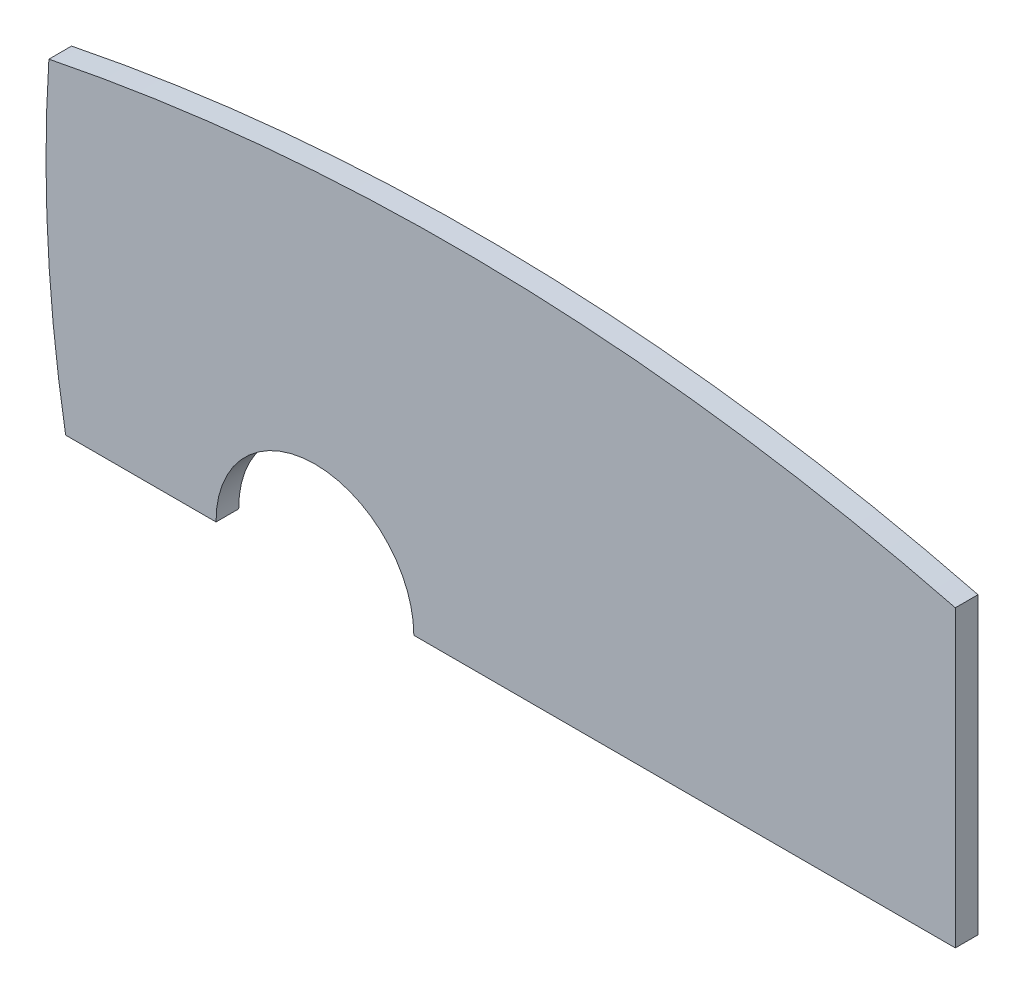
from build123d import *

# Parameters (mm, degrees)
LINEAR_AUSTRAGEN1_DEPTH = 5


with BuildPart() as part:
    # Skizze1 → Linear austragen1 (new body)
    with BuildSketch(Plane.XY):
        with BuildLine():
            Line((-196.305205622, -65.167726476), (-163.115239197, -65.167726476))
            ThreePointArc((-163.115239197, -65.167726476), (-141.380841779, -43.181255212), (-119.478071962, -65))
            Line((-119.478071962, -65), (0, -65))
            Line((0, -65), (0, 0))
            ThreePointArc((0, 0), (-99.728060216, 13.671285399), (-200, 4.832273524))
            ThreePointArc((-200, 4.832273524), (-200.223489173, -30.277033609), (-196.305205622, -65.167726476))
        make_face()
    extrude(amount=LINEAR_AUSTRAGEN1_DEPTH)


solid = part.part
